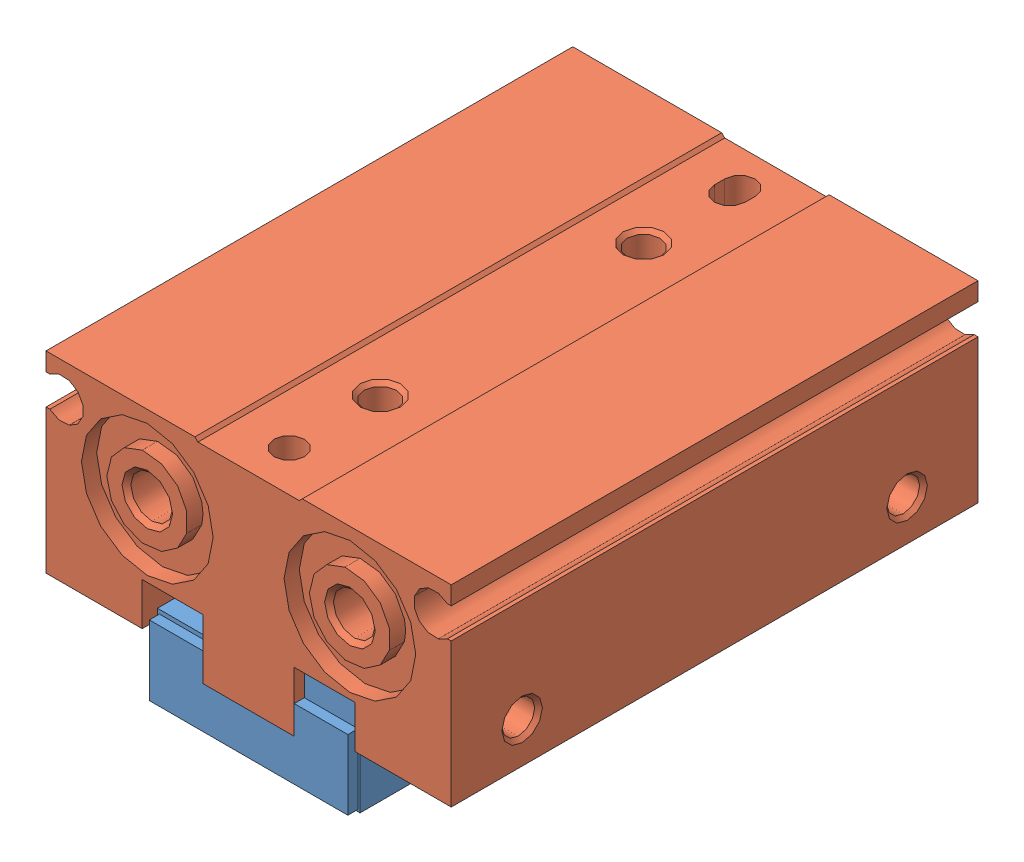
SolidWorks assembly SHF12-12D.sldasm, configuration Default (file format 11000). Lengths in mm.
Overall size (40 25 52).
3 component instances, 2 part files, 0 mates.
Components (placement in the parent):
- SHF12-1202-3: SHF12-1202.sldprt [Default] at (0 -25 -6) x (-1 0 0) z (0 0 -1) size (20 11.8 32)
- SHF12-1202-2: SHF12-1202.sldprt [Default] at (0 -25 6) size (20 11.8 32)
- SHF12-1201-1: SHF12-1201.sldprt [Default] at origin size (40 20.7 52)
